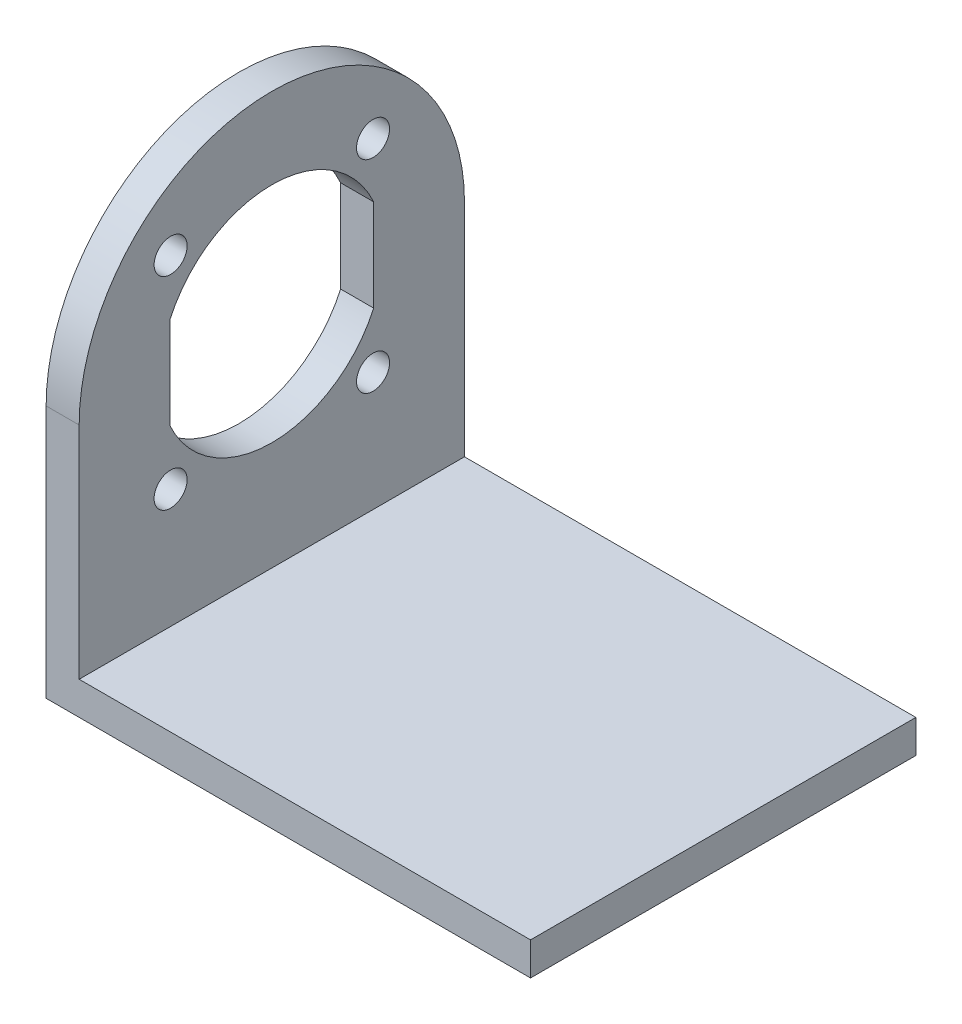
from build123d import *

# Parameters (mm, degrees)
BOSS_EXTRUDE1_DEPTH = 17.5
SKETCH2_R           = 1.5
CUT_EXTRUDE1_DEPTH  = 35


with BuildPart() as part:
    # Sketch1 → Boss-Extrude1 (new, symmetric)
    with BuildSketch(Plane.XY):
        Polygon((0, 0), (0, 40.5), (3, 40.5), (3, 3), (44, 3), (44, 0), align=None)
    extrude(amount=BOSS_EXTRUDE1_DEPTH, both=True)

    # Sketch2 → Cut-Extrude1 (cut)
    with BuildSketch(Plane.ZY):
        with BuildLine():
            Line((9.25, 23), (-9.25, 23))
            Line((-9.25, 23), (-9.25, 18.821483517))
            ThreePointArc((-9.25, 18.821483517), (0, 12.85), (9.25, 18.821483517))
            Line((9.25, 18.821483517), (9.25, 23))
        make_face()
        with BuildLine():
            Line((-9.25, 27.178516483), (-9.25, 23))
            Line((-9.25, 23), (9.25, 23))
            Line((9.25, 23), (9.25, 27.178516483))
            ThreePointArc((9.25, 27.178516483), (0, 33.15), (-9.25, 27.178516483))
        make_face()
        with Locations((-9.192388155, 32.192388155)):
            Circle(SKETCH2_R)
        with Locations((9.192388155, 32.192388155)):
            Circle(SKETCH2_R)
        with Locations((-9.192388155, 13.807611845)):
            Circle(SKETCH2_R)
        with Locations((9.192388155, 13.807611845)):
            Circle(SKETCH2_R)
        with BuildLine():
            Line((-17.5, 40.5), (-17.5, 23))
            ThreePointArc((-17.5, 23), (-12.374368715, 35.374368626), (-1.26e-07, 40.5))
            Line((-1.26e-07, 40.5), (-17.5, 40.5))
        make_face()
        with BuildLine():
            ThreePointArc((-1.26e-07, 40.5), (12.374368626, 35.374368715), (17.5, 23))
            Line((17.5, 23), (17.5, 40.5))
            Line((17.5, 40.5), (-1.26e-07, 40.5))
        make_face()
    extrude(amount=-CUT_EXTRUDE1_DEPTH, mode=Mode.SUBTRACT)


solid = part.part
